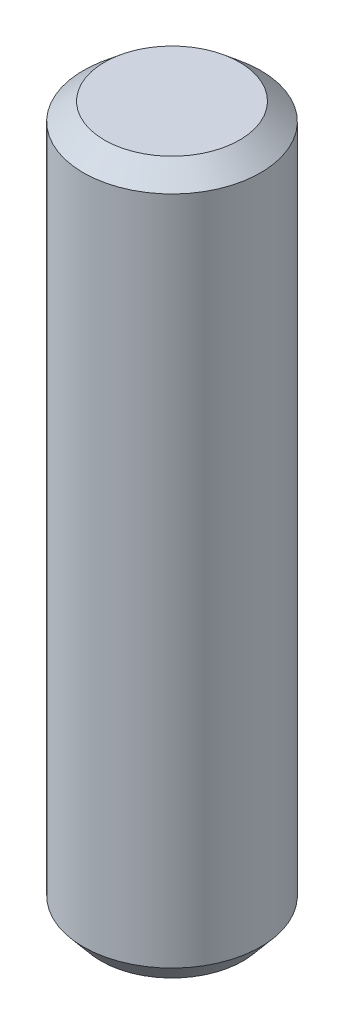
from build123d import *
from OCP.BRepFilletAPI import BRepFilletAPI_MakeChamfer

# Parameters (mm, degrees)
SKETCH1_R           = 5
BOSS_EXTRUDE1_DEPTH = 20
CHAMFER1_SIZE       = 1
CHAMFER1_SIZE2      = 1.191753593


with BuildPart() as part:
    # Sketch1 → Boss-Extrude1 (new, symmetric)
    with BuildSketch(Plane(origin=(0, 0, 0), x_dir=(1, 0, 0), z_dir=(0, 1, 0))):
        with Locations(Location((0, 0, 0), (0, 0, 270))):
            Circle(SKETCH1_R)
    extrude(amount=BOSS_EXTRUDE1_DEPTH, both=True)

    # Chamfer1: one chamfer whose edges measure the first distance from different faces: ONE call of the kernel's chamfer builder (chamfer() names one face for all edges)
    chamfer1_edges_1 = [part.edges().sort_by_distance(p)[0] for p in [
        (0, -20, -5),
    ]]
    chamfer1_side_1 = [part.faces().sort_by_distance(p)[0] for p in [
        (0, -20, 0),
    ]]
    chamfer1_edges_2 = [part.edges().sort_by_distance(p)[0] for p in [
        (0, 20, -5),
    ]]
    chamfer1_side_2 = [part.faces().sort_by_distance(p)[0] for p in [
        (0, 0, -5),
    ]]
    chamfer1 = BRepFilletAPI_MakeChamfer(part.part.solid().wrapped)
    for e in chamfer1_edges_1:
        chamfer1.Add(CHAMFER1_SIZE, CHAMFER1_SIZE2, e.wrapped, chamfer1_side_1[0].wrapped)  # the first distance lies on this face
    for e in chamfer1_edges_2:
        chamfer1.Add(CHAMFER1_SIZE, CHAMFER1_SIZE2, e.wrapped, chamfer1_side_2[0].wrapped)  # the first distance lies on this face
    add(Compound.cast(chamfer1.Shape()), mode=Mode.REPLACE)


solid = part.part
